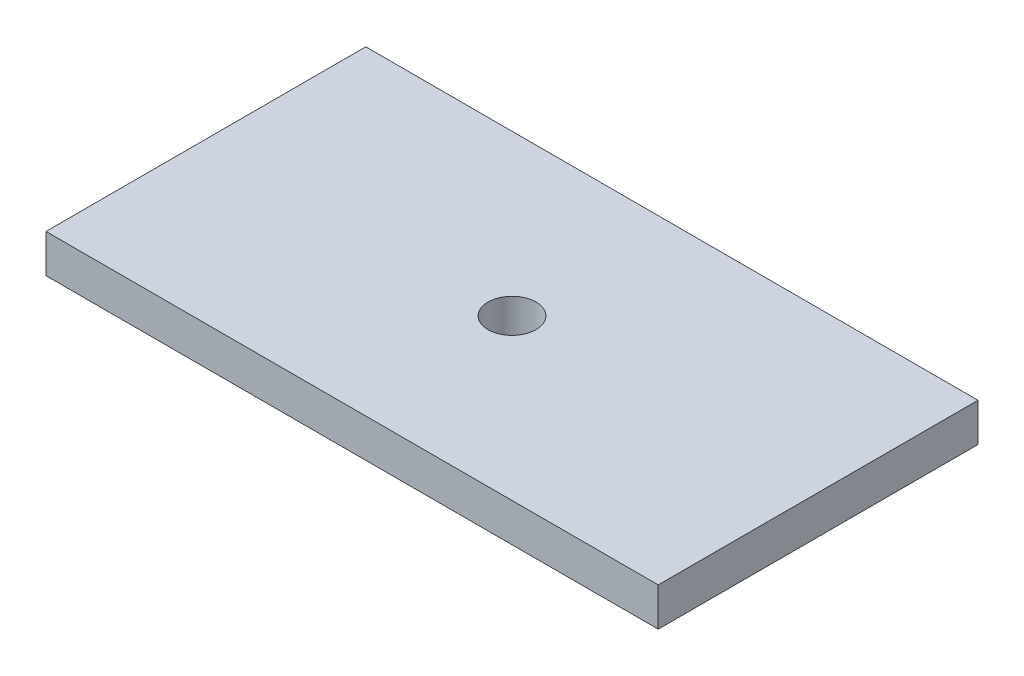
ISO-10303-21;
HEADER;
FILE_DESCRIPTION(('STEP AP214'),'2;1');
FILE_NAME('part.step','',(''),(''),'','','');
FILE_SCHEMA(('AUTOMOTIVE_DESIGN { 1 0 10303 214 1 1 1 1 }'));
ENDSEC;
DATA;
#1=APPLICATION_CONTEXT('core data for automotive mechanical design processes');
#2=APPLICATION_PROTOCOL_DEFINITION('international standard','automotive_design',2000,#1);
#3=PRODUCT_CONTEXT('',#1,'mechanical');
#4=PRODUCT('Part','Part','',(#3));
#5=PRODUCT_RELATED_PRODUCT_CATEGORY('part','',(#4));
#6=PRODUCT_DEFINITION_FORMATION('','',#4);
#7=PRODUCT_DEFINITION_CONTEXT('part definition',#1,'design');
#8=PRODUCT_DEFINITION('design','',#6,#7);
#9=PRODUCT_DEFINITION_SHAPE('','',#8);
#10=(LENGTH_UNIT() NAMED_UNIT(*) SI_UNIT(.MILLI.,.METRE.));
#11=(NAMED_UNIT(*) PLANE_ANGLE_UNIT() SI_UNIT($,.RADIAN.));
#12=(NAMED_UNIT(*) SI_UNIT($,.STERADIAN.) SOLID_ANGLE_UNIT());
#13=UNCERTAINTY_MEASURE_WITH_UNIT(LENGTH_MEASURE(1.E-05),#10,'distance_accuracy_value','');
#14=(GEOMETRIC_REPRESENTATION_CONTEXT(3) GLOBAL_UNCERTAINTY_ASSIGNED_CONTEXT((#13)) GLOBAL_UNIT_ASSIGNED_CONTEXT((#10,
#11,#12)) REPRESENTATION_CONTEXT('',''));
#15=CARTESIAN_POINT('',(0.,0.,0.));
#16=DIRECTION('',(0.,0.,1.));
#17=DIRECTION('',(1.,0.,0.));
#18=AXIS2_PLACEMENT_3D('',#15,#16,#17);
#19=CARTESIAN_POINT('',(0.,7.62,31.75));
#20=DIRECTION('',(0.,0.,-1.));
#21=DIRECTION('',(-1.,0.,0.));
#22=AXIS2_PLACEMENT_3D('',#19,#20,#21);
#23=PLANE('',#22);
#24=DIRECTION('',(1.,0.,0.));
#25=VECTOR('',#24,1.);
#26=CARTESIAN_POINT('',(0.,0.,31.75));
#27=LINE('',#26,#25);
#28=CARTESIAN_POINT('',(-60.7877775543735,0.,31.75));
#29=VERTEX_POINT('',#28);
#30=CARTESIAN_POINT('',(60.7877775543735,0.,31.75));
#31=VERTEX_POINT('',#30);
#32=EDGE_CURVE('E102',#29,#31,#27,.T.);
#33=ORIENTED_EDGE('',*,*,#32,.T.);
#34=DIRECTION('',(0.,-1.,0.));
#35=VECTOR('',#34,1.);
#36=CARTESIAN_POINT('',(60.7877775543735,7.62,31.75));
#37=LINE('',#36,#35);
#38=CARTESIAN_POINT('',(60.7877775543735,7.62,31.75));
#39=VERTEX_POINT('',#38);
#40=EDGE_CURVE('E11',#39,#31,#37,.T.);
#41=ORIENTED_EDGE('',*,*,#40,.F.);
#42=DIRECTION('',(1.,0.,0.));
#43=VECTOR('',#42,1.);
#44=CARTESIAN_POINT('',(0.,7.62,31.75));
#45=LINE('',#44,#43);
#46=CARTESIAN_POINT('',(-60.7877775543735,7.62,31.75));
#47=VERTEX_POINT('',#46);
#48=EDGE_CURVE('E85',#47,#39,#45,.T.);
#49=ORIENTED_EDGE('',*,*,#48,.F.);
#50=DIRECTION('',(0.,-1.,0.));
#51=VECTOR('',#50,1.);
#52=CARTESIAN_POINT('',(-60.7877775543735,7.62,31.75));
#53=LINE('',#52,#51);
#54=EDGE_CURVE('E52',#47,#29,#53,.T.);
#55=ORIENTED_EDGE('',*,*,#54,.T.);
#56=EDGE_LOOP('',(#33,#41,#49,#55));
#57=FACE_BOUND('',#56,.T.);
#58=ADVANCED_FACE('F35',(#57),#23,.F.);
#59=CARTESIAN_POINT('',(60.7877775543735,7.62,0.));
#60=DIRECTION('',(-1.,0.,0.));
#61=DIRECTION('',(0.,0.,1.));
#62=AXIS2_PLACEMENT_3D('',#59,#60,#61);
#63=PLANE('',#62);
#64=DIRECTION('',(0.,0.,-1.));
#65=VECTOR('',#64,1.);
#66=CARTESIAN_POINT('',(60.7877775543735,0.,0.));
#67=LINE('',#66,#65);
#68=CARTESIAN_POINT('',(60.7877775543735,0.,-31.75));
#69=VERTEX_POINT('',#68);
#70=EDGE_CURVE('E90',#31,#69,#67,.T.);
#71=ORIENTED_EDGE('',*,*,#70,.T.);
#72=DIRECTION('',(0.,-1.,0.));
#73=VECTOR('',#72,1.);
#74=CARTESIAN_POINT('',(60.7877775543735,7.62,-31.75));
#75=LINE('',#74,#73);
#76=CARTESIAN_POINT('',(60.7877775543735,7.62,-31.75));
#77=VERTEX_POINT('',#76);
#78=EDGE_CURVE('E44',#77,#69,#75,.T.);
#79=ORIENTED_EDGE('',*,*,#78,.F.);
#80=DIRECTION('',(0.,0.,-1.));
#81=VECTOR('',#80,1.);
#82=CARTESIAN_POINT('',(60.7877775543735,7.62,0.));
#83=LINE('',#82,#81);
#84=EDGE_CURVE('E77',#39,#77,#83,.T.);
#85=ORIENTED_EDGE('',*,*,#84,.F.);
#86=ORIENTED_EDGE('',*,*,#40,.T.);
#87=EDGE_LOOP('',(#71,#79,#85,#86));
#88=FACE_BOUND('',#87,.T.);
#89=ADVANCED_FACE('F89',(#88),#63,.F.);
#90=CARTESIAN_POINT('',(0.,7.62,-31.75));
#91=DIRECTION('',(0.,0.,-1.));
#92=DIRECTION('',(-1.,0.,0.));
#93=AXIS2_PLACEMENT_3D('',#90,#91,#92);
#94=PLANE('',#93);
#95=DIRECTION('',(1.,0.,0.));
#96=VECTOR('',#95,1.);
#97=CARTESIAN_POINT('',(0.,0.,-31.75));
#98=LINE('',#97,#96);
#99=CARTESIAN_POINT('',(-60.7877775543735,0.,-31.75));
#100=VERTEX_POINT('',#99);
#101=EDGE_CURVE('E105',#100,#69,#98,.T.);
#102=ORIENTED_EDGE('',*,*,#101,.F.);
#103=DIRECTION('',(0.,-1.,0.));
#104=VECTOR('',#103,1.);
#105=CARTESIAN_POINT('',(-60.7877775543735,7.62,-31.75));
#106=LINE('',#105,#104);
#107=CARTESIAN_POINT('',(-60.7877775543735,7.62,-31.75));
#108=VERTEX_POINT('',#107);
#109=EDGE_CURVE('E66',#108,#100,#106,.T.);
#110=ORIENTED_EDGE('',*,*,#109,.F.);
#111=DIRECTION('',(1.,0.,0.));
#112=VECTOR('',#111,1.);
#113=CARTESIAN_POINT('',(0.,7.62,-31.75));
#114=LINE('',#113,#112);
#115=EDGE_CURVE('E84',#108,#77,#114,.T.);
#116=ORIENTED_EDGE('',*,*,#115,.T.);
#117=ORIENTED_EDGE('',*,*,#78,.T.);
#118=EDGE_LOOP('',(#102,#110,#116,#117));
#119=FACE_BOUND('',#118,.T.);
#120=ADVANCED_FACE('F93',(#119),#94,.T.);
#121=CARTESIAN_POINT('',(0.,7.62,0.));
#122=DIRECTION('',(0.,-1.,0.));
#123=DIRECTION('',(0.,0.,-1.));
#124=AXIS2_PLACEMENT_3D('',#121,#122,#123);
#125=CYLINDRICAL_SURFACE('',#124,4.7625);
#126=CARTESIAN_POINT('',(0.,7.62,0.));
#127=DIRECTION('',(0.,1.,0.));
#128=DIRECTION('',(0.,0.,1.));
#129=AXIS2_PLACEMENT_3D('',#126,#127,#128);
#130=CIRCLE('',#129,4.7625);
#131=CARTESIAN_POINT('',(0.,7.62,4.7625));
#132=VERTEX_POINT('',#131);
#133=EDGE_CURVE('E110',#132,#132,#130,.T.);
#134=ORIENTED_EDGE('',*,*,#133,.T.);
#135=EDGE_LOOP('',(#134));
#136=FACE_BOUND('',#135,.T.);
#137=CARTESIAN_POINT('',(0.,0.,0.));
#138=DIRECTION('',(0.,1.,0.));
#139=DIRECTION('',(0.,0.,1.));
#140=AXIS2_PLACEMENT_3D('',#137,#138,#139);
#141=CIRCLE('',#140,4.7625);
#142=CARTESIAN_POINT('',(0.,0.,4.7625));
#143=VERTEX_POINT('',#142);
#144=EDGE_CURVE('E99',#143,#143,#141,.T.);
#145=ORIENTED_EDGE('',*,*,#144,.F.);
#146=EDGE_LOOP('',(#145));
#147=FACE_BOUND('',#146,.T.);
#148=ADVANCED_FACE('F37',(#136,#147),#125,.F.);
#149=CARTESIAN_POINT('',(-60.7877775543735,7.62,0.));
#150=DIRECTION('',(-1.,0.,0.));
#151=DIRECTION('',(0.,0.,1.));
#152=AXIS2_PLACEMENT_3D('',#149,#150,#151);
#153=PLANE('',#152);
#154=DIRECTION('',(0.,0.,-1.));
#155=VECTOR('',#154,1.);
#156=CARTESIAN_POINT('',(-60.7877775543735,0.,0.));
#157=LINE('',#156,#155);
#158=EDGE_CURVE('E107',#29,#100,#157,.T.);
#159=ORIENTED_EDGE('',*,*,#158,.F.);
#160=ORIENTED_EDGE('',*,*,#54,.F.);
#161=DIRECTION('',(0.,0.,-1.));
#162=VECTOR('',#161,1.);
#163=CARTESIAN_POINT('',(-60.7877775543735,7.62,0.));
#164=LINE('',#163,#162);
#165=EDGE_CURVE('E94',#47,#108,#164,.T.);
#166=ORIENTED_EDGE('',*,*,#165,.T.);
#167=ORIENTED_EDGE('',*,*,#109,.T.);
#168=EDGE_LOOP('',(#159,#160,#166,#167));
#169=FACE_BOUND('',#168,.T.);
#170=ADVANCED_FACE('F121',(#169),#153,.T.);
#171=CARTESIAN_POINT('',(0.,7.62,0.));
#172=DIRECTION('',(0.,1.,0.));
#173=DIRECTION('',(0.,0.,1.));
#174=AXIS2_PLACEMENT_3D('',#171,#172,#173);
#175=PLANE('',#174);
#176=ORIENTED_EDGE('',*,*,#133,.F.);
#177=EDGE_LOOP('',(#176));
#178=FACE_BOUND('',#177,.T.);
#179=ORIENTED_EDGE('',*,*,#48,.T.);
#180=ORIENTED_EDGE('',*,*,#84,.T.);
#181=ORIENTED_EDGE('',*,*,#115,.F.);
#182=ORIENTED_EDGE('',*,*,#165,.F.);
#183=EDGE_LOOP('',(#179,#180,#181,#182));
#184=FACE_BOUND('',#183,.T.);
#185=ADVANCED_FACE('F81',(#178,#184),#175,.T.);
#186=CARTESIAN_POINT('',(0.,0.,0.));
#187=DIRECTION('',(0.,1.,0.));
#188=DIRECTION('',(0.,0.,1.));
#189=AXIS2_PLACEMENT_3D('',#186,#187,#188);
#190=PLANE('',#189);
#191=ORIENTED_EDGE('',*,*,#144,.T.);
#192=EDGE_LOOP('',(#191));
#193=FACE_BOUND('',#192,.T.);
#194=ORIENTED_EDGE('',*,*,#32,.F.);
#195=ORIENTED_EDGE('',*,*,#158,.T.);
#196=ORIENTED_EDGE('',*,*,#101,.T.);
#197=ORIENTED_EDGE('',*,*,#70,.F.);
#198=EDGE_LOOP('',(#194,#195,#196,#197));
#199=FACE_BOUND('',#198,.T.);
#200=ADVANCED_FACE('F120',(#193,#199),#190,.F.);
#201=CLOSED_SHELL('',(#58,#89,#120,#148,#170,#185,#200));
#202=MANIFOLD_SOLID_BREP('B2',#201);
#203=ADVANCED_BREP_SHAPE_REPRESENTATION('',(#18,#202),#14);
#204=SHAPE_DEFINITION_REPRESENTATION(#9,#203);
ENDSEC;
END-ISO-10303-21;
